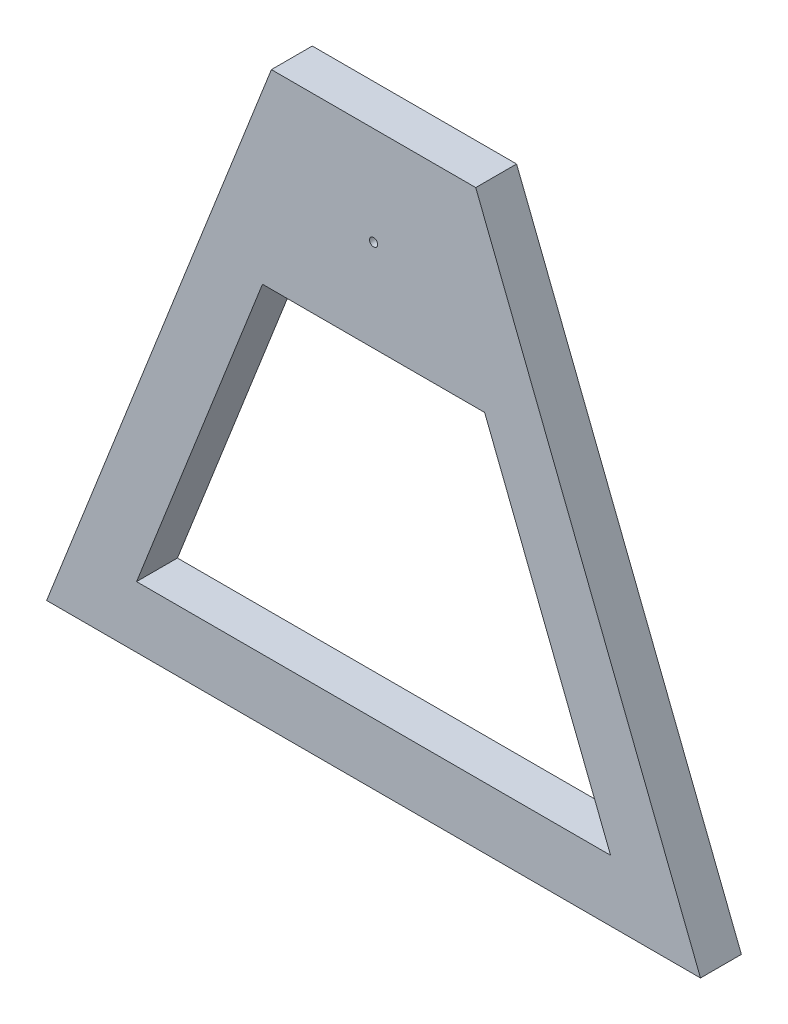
from build123d import *

# Parameters (mm, degrees)
BOSS_EXTRUDE1_DEPTH = 100
CUT_EXTRUDE2_DEPTH  = 1616.54944214
CUT_EXTRUDE3_REACH  = 1617.549
SKETCH5_R           = 10


with BuildPart() as part:
    # Sketch1 → Boss-Extrude1 (new body)
    with BuildSketch(Plane.XY):
        Polygon((-800, 0), (800, 0), (250, 1400), (-250, 1400), align=None)
    extrude(amount=BOSS_EXTRUDE1_DEPTH)

    # Sketch4 → Cut-Extrude2 (cut, through all)
    with BuildSketch(Plane.XY):
        Polygon((-579.911332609, 150), (579.911332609, 150), (271.77776118, 934.34), (-271.77776118, 934.34), align=None)
    extrude(amount=CUT_EXTRUDE2_DEPTH, mode=Mode.SUBTRACT)

    # Sketch5 → Cut-Extrude3 (cut, up to next)
    with BuildSketch(Plane.XY.offset(100), mode=Mode.PRIVATE) as cut_extrude3_sk1:
        with Locations((0, 1159.34)):
            Circle(SKETCH5_R)
    cut_extrude3_tool1 = extrude(cut_extrude3_sk1.sketch, amount=-CUT_EXTRUDE3_REACH, mode=Mode.PRIVATE) & part.part
    add(cut_extrude3_tool1.solids().sort_by_distance((0, 1159.34, 100))[0], mode=Mode.SUBTRACT)


solid = part.part
